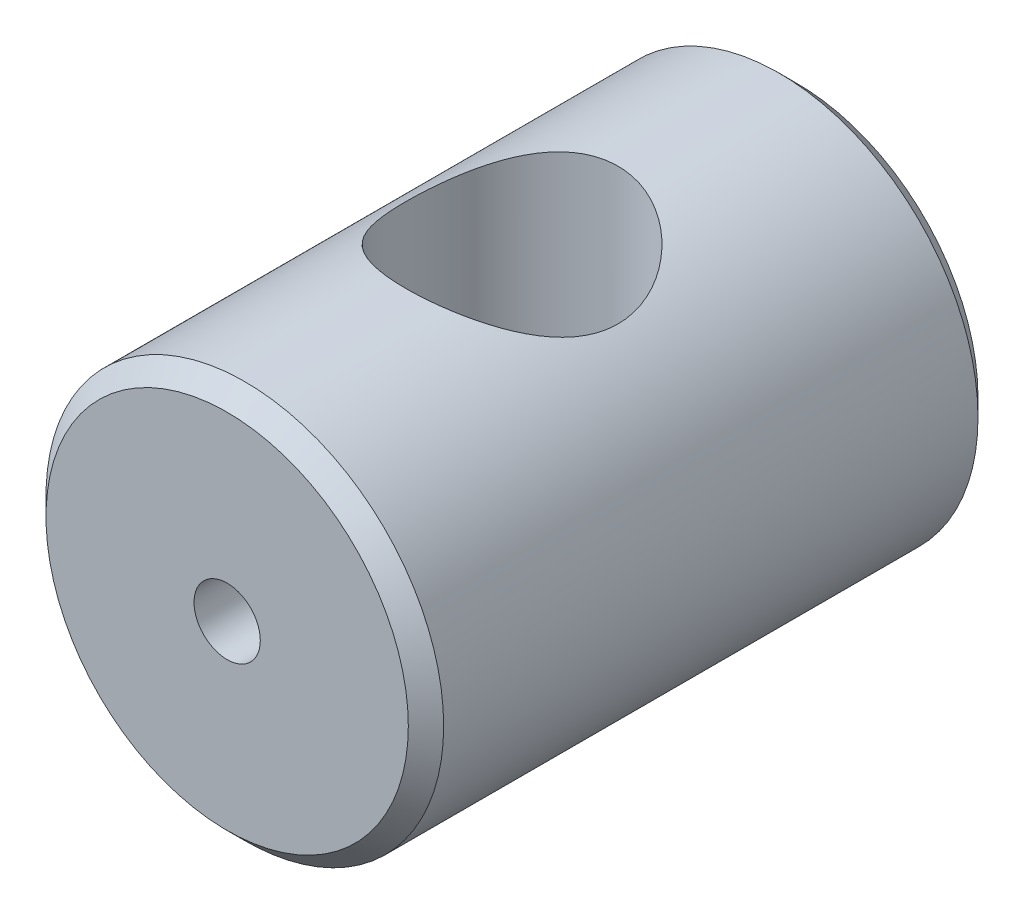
from build123d import *

# Parameters (mm, degrees)
ESQUISSE2_R      = 12
EXTRUSION1_DEPTH = 30


with BuildPart() as part:
    # Esquisse1 → R_volution1 (revolve)
    with BuildSketch(Plane(origin=(0, 0, 0), x_dir=(0, 0, -1), z_dir=(1, 0, 0)), mode=Mode.PRIVATE) as r_volution1_sk:
        Polygon((0, 3.75), (0, 20.5), (2, 22.5), (62.46576281, 22.5), (64.46576281, 20.5), (64.46576281, 3.75), align=None)
    revolve(r_volution1_sk.sketch.rotate(Axis((0, 0, 0), (0, 0, -1)), 90), axis=Axis((0, 0, 0), (0, 0, -1)))

    # Esquisse2 → Extrusion1 (cut, symmetric)
    with BuildSketch(Plane(origin=(0, 0, 0), x_dir=(1, 0, 0), z_dir=(0, 1, 0))):
        with Locations(Location((0, 32.232881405, 0), (0, 0, 270))):
            Circle(ESQUISSE2_R)
    extrude(amount=EXTRUSION1_DEPTH, both=True, mode=Mode.SUBTRACT)


solid = part.part
